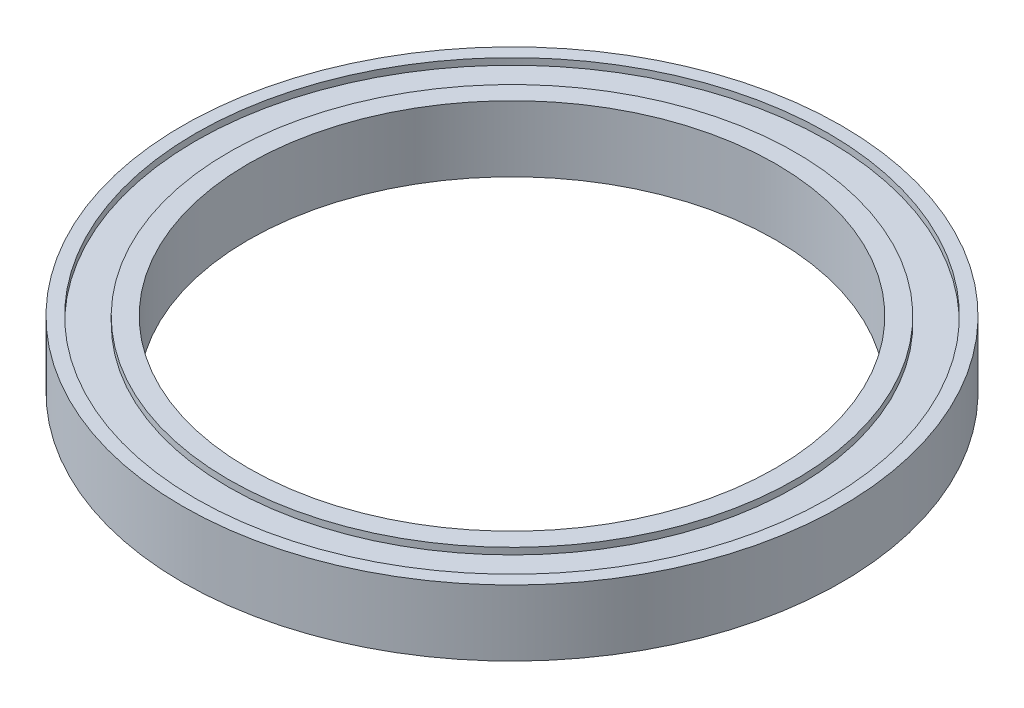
ISO-10303-21;
HEADER;
FILE_DESCRIPTION(('STEP AP214'),'2;1');
FILE_NAME('part.step','',(''),(''),'','','');
FILE_SCHEMA(('AUTOMOTIVE_DESIGN { 1 0 10303 214 1 1 1 1 }'));
ENDSEC;
DATA;
#1=APPLICATION_CONTEXT('core data for automotive mechanical design processes');
#2=APPLICATION_PROTOCOL_DEFINITION('international standard','automotive_design',2000,#1);
#3=PRODUCT_CONTEXT('',#1,'mechanical');
#4=PRODUCT('Part','Part','',(#3));
#5=PRODUCT_RELATED_PRODUCT_CATEGORY('part','',(#4));
#6=PRODUCT_DEFINITION_FORMATION('','',#4);
#7=PRODUCT_DEFINITION_CONTEXT('part definition',#1,'design');
#8=PRODUCT_DEFINITION('design','',#6,#7);
#9=PRODUCT_DEFINITION_SHAPE('','',#8);
#10=(LENGTH_UNIT() NAMED_UNIT(*) SI_UNIT(.MILLI.,.METRE.));
#11=(NAMED_UNIT(*) PLANE_ANGLE_UNIT() SI_UNIT($,.RADIAN.));
#12=(NAMED_UNIT(*) SI_UNIT($,.STERADIAN.) SOLID_ANGLE_UNIT());
#13=UNCERTAINTY_MEASURE_WITH_UNIT(LENGTH_MEASURE(1.E-05),#10,'distance_accuracy_value','');
#14=(GEOMETRIC_REPRESENTATION_CONTEXT(3) GLOBAL_UNCERTAINTY_ASSIGNED_CONTEXT((#13)) GLOBAL_UNIT_ASSIGNED_CONTEXT((#10,
#11,#12)) REPRESENTATION_CONTEXT('',''));
#15=CARTESIAN_POINT('',(0.,0.,0.));
#16=DIRECTION('',(0.,0.,1.));
#17=DIRECTION('',(1.,0.,0.));
#18=AXIS2_PLACEMENT_3D('',#15,#16,#17);
#19=CARTESIAN_POINT('',(0.,0.,0.));
#20=DIRECTION('',(0.,1.,0.));
#21=DIRECTION('',(0.,0.,1.));
#22=AXIS2_PLACEMENT_3D('',#19,#20,#21);
#23=PLANE('',#22);
#24=CARTESIAN_POINT('',(0.,0.,0.));
#25=DIRECTION('',(0.,1.,0.));
#26=DIRECTION('',(0.,0.,1.));
#27=AXIS2_PLACEMENT_3D('',#24,#25,#26);
#28=CIRCLE('',#27,40.);
#29=CARTESIAN_POINT('',(0.,0.,40.));
#30=VERTEX_POINT('',#29);
#31=EDGE_CURVE('E46',#30,#30,#28,.T.);
#32=ORIENTED_EDGE('',*,*,#31,.T.);
#33=EDGE_LOOP('',(#32));
#34=FACE_BOUND('',#33,.T.);
#35=CARTESIAN_POINT('',(0.,0.,0.));
#36=DIRECTION('',(0.,-1.,0.));
#37=DIRECTION('',(0.,0.,-1.));
#38=AXIS2_PLACEMENT_3D('',#35,#36,#37);
#39=CIRCLE('',#38,43.);
#40=CARTESIAN_POINT('',(0.,0.,-43.));
#41=VERTEX_POINT('',#40);
#42=EDGE_CURVE('E70',#41,#41,#39,.T.);
#43=ORIENTED_EDGE('',*,*,#42,.T.);
#44=EDGE_LOOP('',(#43));
#45=FACE_BOUND('',#44,.T.);
#46=ADVANCED_FACE('F33',(#34,#45),#23,.F.);
#47=CARTESIAN_POINT('',(0.,10.,0.));
#48=DIRECTION('',(0.,1.,0.));
#49=DIRECTION('',(0.,0.,1.));
#50=AXIS2_PLACEMENT_3D('',#47,#48,#49);
#51=PLANE('',#50);
#52=CARTESIAN_POINT('',(0.,10.,0.));
#53=DIRECTION('',(0.,1.,0.));
#54=DIRECTION('',(0.,0.,1.));
#55=AXIS2_PLACEMENT_3D('',#52,#53,#54);
#56=CIRCLE('',#55,40.);
#57=CARTESIAN_POINT('',(0.,10.,40.));
#58=VERTEX_POINT('',#57);
#59=EDGE_CURVE('E44',#58,#58,#56,.T.);
#60=ORIENTED_EDGE('',*,*,#59,.F.);
#61=EDGE_LOOP('',(#60));
#62=FACE_BOUND('',#61,.T.);
#63=CARTESIAN_POINT('',(0.,10.,0.));
#64=DIRECTION('',(0.,1.,0.));
#65=DIRECTION('',(0.,0.,1.));
#66=AXIS2_PLACEMENT_3D('',#63,#64,#65);
#67=CIRCLE('',#66,43.);
#68=CARTESIAN_POINT('',(0.,10.,43.));
#69=VERTEX_POINT('',#68);
#70=EDGE_CURVE('E58',#69,#69,#67,.T.);
#71=ORIENTED_EDGE('',*,*,#70,.T.);
#72=EDGE_LOOP('',(#71));
#73=FACE_BOUND('',#72,.T.);
#74=ADVANCED_FACE('F108',(#62,#73),#51,.T.);
#75=CARTESIAN_POINT('',(0.,10.,0.));
#76=DIRECTION('',(0.,1.,0.));
#77=DIRECTION('',(0.,0.,1.));
#78=AXIS2_PLACEMENT_3D('',#75,#76,#77);
#79=CIRCLE('',#78,48.);
#80=CARTESIAN_POINT('',(0.,10.,48.));
#81=VERTEX_POINT('',#80);
#82=EDGE_CURVE('E52',#81,#81,#79,.T.);
#83=ORIENTED_EDGE('',*,*,#82,.F.);
#84=EDGE_LOOP('',(#83));
#85=FACE_BOUND('',#84,.T.);
#86=CARTESIAN_POINT('',(0.,10.,0.));
#87=DIRECTION('',(0.,1.,0.));
#88=DIRECTION('',(0.,0.,1.));
#89=AXIS2_PLACEMENT_3D('',#86,#87,#88);
#90=CIRCLE('',#89,50.);
#91=CARTESIAN_POINT('',(0.,10.,50.));
#92=VERTEX_POINT('',#91);
#93=EDGE_CURVE('E10',#92,#92,#90,.T.);
#94=ORIENTED_EDGE('',*,*,#93,.T.);
#95=EDGE_LOOP('',(#94));
#96=FACE_BOUND('',#95,.T.);
#97=ADVANCED_FACE('F95',(#85,#96),#51,.T.);
#98=CARTESIAN_POINT('',(0.,0.,0.));
#99=DIRECTION('',(0.,-1.,0.));
#100=DIRECTION('',(0.,0.,-1.));
#101=AXIS2_PLACEMENT_3D('',#98,#99,#100);
#102=CIRCLE('',#101,48.);
#103=CARTESIAN_POINT('',(0.,0.,-48.));
#104=VERTEX_POINT('',#103);
#105=EDGE_CURVE('E64',#104,#104,#102,.T.);
#106=ORIENTED_EDGE('',*,*,#105,.F.);
#107=EDGE_LOOP('',(#106));
#108=FACE_BOUND('',#107,.T.);
#109=CARTESIAN_POINT('',(0.,0.,0.));
#110=DIRECTION('',(0.,1.,0.));
#111=DIRECTION('',(0.,0.,1.));
#112=AXIS2_PLACEMENT_3D('',#109,#110,#111);
#113=CIRCLE('',#112,50.);
#114=CARTESIAN_POINT('',(0.,0.,50.));
#115=VERTEX_POINT('',#114);
#116=EDGE_CURVE('E37',#115,#115,#113,.T.);
#117=ORIENTED_EDGE('',*,*,#116,.F.);
#118=EDGE_LOOP('',(#117));
#119=FACE_BOUND('',#118,.T.);
#120=ADVANCED_FACE('F92',(#108,#119),#23,.F.);
#121=CARTESIAN_POINT('',(0.,10.,0.));
#122=DIRECTION('',(0.,-1.,0.));
#123=DIRECTION('',(0.,0.,-1.));
#124=AXIS2_PLACEMENT_3D('',#121,#122,#123);
#125=CYLINDRICAL_SURFACE('',#124,50.);
#126=ORIENTED_EDGE('',*,*,#93,.F.);
#127=EDGE_LOOP('',(#126));
#128=FACE_BOUND('',#127,.T.);
#129=ORIENTED_EDGE('',*,*,#116,.T.);
#130=EDGE_LOOP('',(#129));
#131=FACE_BOUND('',#130,.T.);
#132=ADVANCED_FACE('F35',(#128,#131),#125,.T.);
#133=CARTESIAN_POINT('',(0.,10.,0.));
#134=DIRECTION('',(0.,-1.,0.));
#135=DIRECTION('',(0.,0.,-1.));
#136=AXIS2_PLACEMENT_3D('',#133,#134,#135);
#137=CYLINDRICAL_SURFACE('',#136,40.);
#138=ORIENTED_EDGE('',*,*,#59,.T.);
#139=EDGE_LOOP('',(#138));
#140=FACE_BOUND('',#139,.T.);
#141=ORIENTED_EDGE('',*,*,#31,.F.);
#142=EDGE_LOOP('',(#141));
#143=FACE_BOUND('',#142,.T.);
#144=ADVANCED_FACE('F99',(#140,#143),#137,.F.);
#145=CARTESIAN_POINT('',(0.,9.,0.));
#146=DIRECTION('',(0.,1.,0.));
#147=DIRECTION('',(0.,0.,1.));
#148=AXIS2_PLACEMENT_3D('',#145,#146,#147);
#149=CYLINDRICAL_SURFACE('',#148,48.);
#150=CARTESIAN_POINT('',(0.,9.,0.));
#151=DIRECTION('',(0.,1.,0.));
#152=DIRECTION('',(0.,0.,1.));
#153=AXIS2_PLACEMENT_3D('',#150,#151,#152);
#154=CIRCLE('',#153,48.);
#155=CARTESIAN_POINT('',(0.,9.,48.));
#156=VERTEX_POINT('',#155);
#157=EDGE_CURVE('E49',#156,#156,#154,.T.);
#158=ORIENTED_EDGE('',*,*,#157,.F.);
#159=EDGE_LOOP('',(#158));
#160=FACE_BOUND('',#159,.T.);
#161=ORIENTED_EDGE('',*,*,#82,.T.);
#162=EDGE_LOOP('',(#161));
#163=FACE_BOUND('',#162,.T.);
#164=ADVANCED_FACE('F104',(#160,#163),#149,.F.);
#165=CARTESIAN_POINT('',(0.,9.,0.));
#166=DIRECTION('',(0.,1.,0.));
#167=DIRECTION('',(0.,0.,1.));
#168=AXIS2_PLACEMENT_3D('',#165,#166,#167);
#169=PLANE('',#168);
#170=CARTESIAN_POINT('',(0.,9.,0.));
#171=DIRECTION('',(0.,1.,0.));
#172=DIRECTION('',(0.,0.,1.));
#173=AXIS2_PLACEMENT_3D('',#170,#171,#172);
#174=CIRCLE('',#173,43.);
#175=CARTESIAN_POINT('',(0.,9.,43.));
#176=VERTEX_POINT('',#175);
#177=EDGE_CURVE('E55',#176,#176,#174,.T.);
#178=ORIENTED_EDGE('',*,*,#177,.F.);
#179=EDGE_LOOP('',(#178));
#180=FACE_BOUND('',#179,.T.);
#181=ORIENTED_EDGE('',*,*,#157,.T.);
#182=EDGE_LOOP('',(#181));
#183=FACE_BOUND('',#182,.T.);
#184=ADVANCED_FACE('F121',(#180,#183),#169,.T.);
#185=CARTESIAN_POINT('',(0.,9.,0.));
#186=DIRECTION('',(0.,1.,0.));
#187=DIRECTION('',(0.,0.,1.));
#188=AXIS2_PLACEMENT_3D('',#185,#186,#187);
#189=CYLINDRICAL_SURFACE('',#188,43.);
#190=ORIENTED_EDGE('',*,*,#177,.T.);
#191=EDGE_LOOP('',(#190));
#192=FACE_BOUND('',#191,.T.);
#193=ORIENTED_EDGE('',*,*,#70,.F.);
#194=EDGE_LOOP('',(#193));
#195=FACE_BOUND('',#194,.T.);
#196=ADVANCED_FACE('F88',(#192,#195),#189,.T.);
#197=CARTESIAN_POINT('',(0.,1.,0.));
#198=DIRECTION('',(0.,-1.,0.));
#199=DIRECTION('',(0.,0.,-1.));
#200=AXIS2_PLACEMENT_3D('',#197,#198,#199);
#201=CYLINDRICAL_SURFACE('',#200,48.);
#202=CARTESIAN_POINT('',(0.,1.,0.));
#203=DIRECTION('',(0.,-1.,0.));
#204=DIRECTION('',(0.,0.,-1.));
#205=AXIS2_PLACEMENT_3D('',#202,#203,#204);
#206=CIRCLE('',#205,48.);
#207=CARTESIAN_POINT('',(0.,1.,-48.));
#208=VERTEX_POINT('',#207);
#209=EDGE_CURVE('E61',#208,#208,#206,.T.);
#210=ORIENTED_EDGE('',*,*,#209,.F.);
#211=EDGE_LOOP('',(#210));
#212=FACE_BOUND('',#211,.T.);
#213=ORIENTED_EDGE('',*,*,#105,.T.);
#214=EDGE_LOOP('',(#213));
#215=FACE_BOUND('',#214,.T.);
#216=ADVANCED_FACE('F82',(#212,#215),#201,.F.);
#217=CARTESIAN_POINT('',(0.,1.,0.));
#218=DIRECTION('',(0.,-1.,0.));
#219=DIRECTION('',(0.,0.,-1.));
#220=AXIS2_PLACEMENT_3D('',#217,#218,#219);
#221=PLANE('',#220);
#222=CARTESIAN_POINT('',(0.,1.,0.));
#223=DIRECTION('',(0.,-1.,0.));
#224=DIRECTION('',(0.,0.,-1.));
#225=AXIS2_PLACEMENT_3D('',#222,#223,#224);
#226=CIRCLE('',#225,43.);
#227=CARTESIAN_POINT('',(0.,1.,-43.));
#228=VERTEX_POINT('',#227);
#229=EDGE_CURVE('E67',#228,#228,#226,.T.);
#230=ORIENTED_EDGE('',*,*,#229,.F.);
#231=EDGE_LOOP('',(#230));
#232=FACE_BOUND('',#231,.T.);
#233=ORIENTED_EDGE('',*,*,#209,.T.);
#234=EDGE_LOOP('',(#233));
#235=FACE_BOUND('',#234,.T.);
#236=ADVANCED_FACE('F79',(#232,#235),#221,.T.);
#237=CARTESIAN_POINT('',(0.,1.,0.));
#238=DIRECTION('',(0.,-1.,0.));
#239=DIRECTION('',(0.,0.,-1.));
#240=AXIS2_PLACEMENT_3D('',#237,#238,#239);
#241=CYLINDRICAL_SURFACE('',#240,43.);
#242=ORIENTED_EDGE('',*,*,#229,.T.);
#243=EDGE_LOOP('',(#242));
#244=FACE_BOUND('',#243,.T.);
#245=ORIENTED_EDGE('',*,*,#42,.F.);
#246=EDGE_LOOP('',(#245));
#247=FACE_BOUND('',#246,.T.);
#248=ADVANCED_FACE('F76',(#244,#247),#241,.T.);
#249=CLOSED_SHELL('',(#46,#74,#97,#120,#132,#144,#164,#184,#196,#216,#236,#248));
#250=MANIFOLD_SOLID_BREP('B2',#249);
#251=ADVANCED_BREP_SHAPE_REPRESENTATION('',(#18,#250),#14);
#252=SHAPE_DEFINITION_REPRESENTATION(#9,#251);
ENDSEC;
END-ISO-10303-21;
